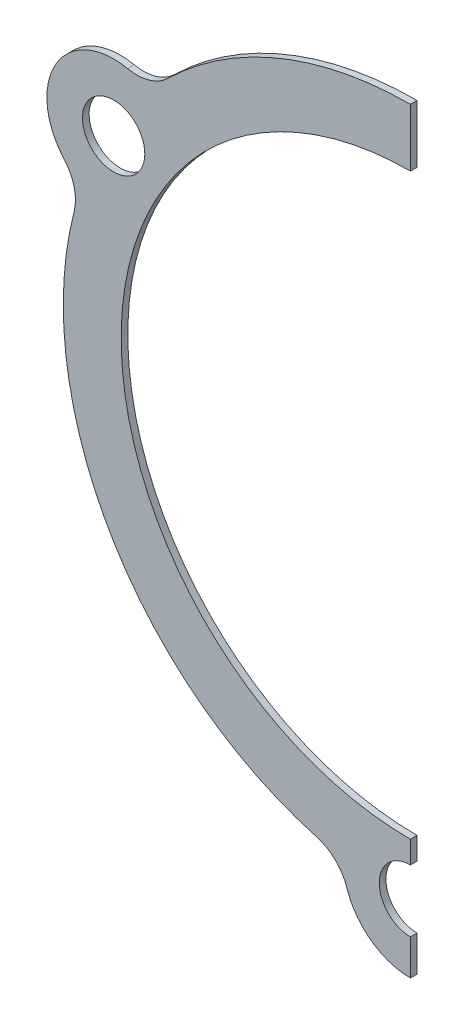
from build123d import *

# Parameters (mm, degrees)
ESQUISSE1_R                  = 65
BASE_EXTRUSION_DEPTH         = 1.5
ESQUISSE2_R                  = 7
ENL_V_MAT_EXTRU_1_DEPTH      = 124.038687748
R_P_TITION_CIRCULAIRE1_COUNT = 3
ESQUISSE3_W                  = 90
ESQUISSE3_H                  = 180
ENL_V_MAT_EXTRU_2_DEPTH      = 124.038687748


with BuildPart() as part:
    # Esquisse1 → Base-Extrusion (new body)
    with BuildSketch(Plane.XY):
        with BuildLine():
            ThreePointArc((21.074015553, -75.099173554), (67.549981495, -39), (75.574799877, 19.298953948))
            ThreePointArc((75.574799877, 19.298953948), (75.554003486, 24.164488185), (77.831908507, 28.463907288))
            ThreePointArc((77.831908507, 28.463907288), (79.674337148, 46), (63.566421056, 53.172456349))
            ThreePointArc((63.566421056, 53.172456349), (58.704062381, 53.349442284), (54.500784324, 55.800219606))
            ThreePointArc((54.500784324, 55.800219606), (0, 78), (-54.500784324, 55.800219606))
            ThreePointArc((-54.500784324, 55.800219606), (-58.704062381, 53.349442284), (-63.566421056, 53.172456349))
            ThreePointArc((-63.566421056, 53.172456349), (-79.674337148, 46), (-77.831908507, 28.463907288))
            ThreePointArc((-77.831908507, 28.463907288), (-75.554003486, 24.164488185), (-75.574799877, 19.298953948))
            ThreePointArc((-75.574799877, 19.298953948), (-67.549981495, -39), (-21.074015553, -75.099173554))
            ThreePointArc((-21.074015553, -75.099173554), (-16.849941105, -77.513930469), (-14.265487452, -81.636363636))
            ThreePointArc((-14.265487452, -81.636363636), (0, -92), (14.265487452, -81.636363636))
            ThreePointArc((14.265487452, -81.636363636), (16.849941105, -77.513930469), (21.074015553, -75.099173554))
        make_face()
        Circle(ESQUISSE1_R, mode=Mode.SUBTRACT)
    extrude(amount=BASE_EXTRUSION_DEPTH)

    # Esquisse2 → Enl_v. mat.-Extru.1 (cut, through all)
    with BuildSketch(Plane.XY.offset(1.5)):
        with Locations((0, -77)):
            Circle(ESQUISSE2_R)
    enl_v_mat_extru_1 = extrude(amount=-ENL_V_MAT_EXTRU_1_DEPTH, mode=Mode.SUBTRACT)

    # R_p_tition circulaire1: Enl_v. mat.-Extru.1 ×3 about axis
    r_p_tition_circulaire1_axis = Axis((0, 0, 51.5), (0, 0, -1))
    for i in range(1, R_P_TITION_CIRCULAIRE1_COUNT):
        add(enl_v_mat_extru_1.rotate(r_p_tition_circulaire1_axis, i * 360 / R_P_TITION_CIRCULAIRE1_COUNT), mode=Mode.SUBTRACT)

    # Esquisse3 → Enl_v. mat.-Extru.2 (cut, through all)
    with BuildSketch(Plane(origin=(0, 0, 0), x_dir=(-1, 0, 0), z_dir=(0, 0, -1))):
        with Locations((-45, -10)):
            Rectangle(ESQUISSE3_W, ESQUISSE3_H)
    extrude(amount=-ENL_V_MAT_EXTRU_2_DEPTH, mode=Mode.SUBTRACT)


solid = part.part
